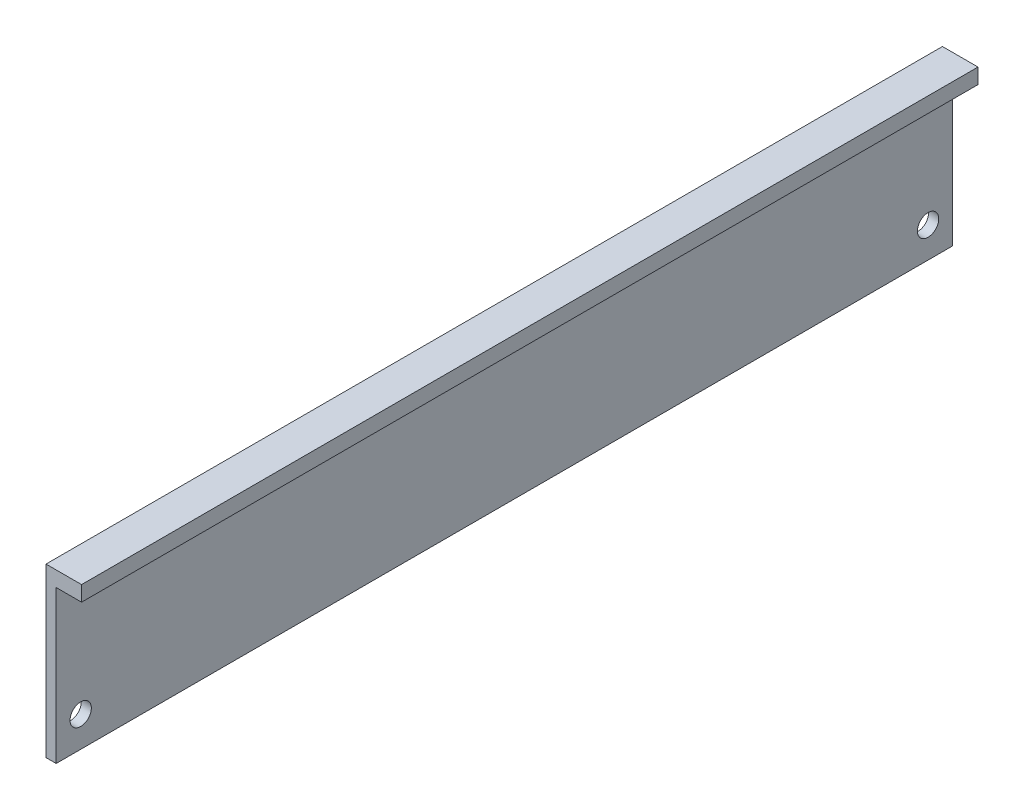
ISO-10303-21;
HEADER;
FILE_DESCRIPTION(('STEP AP214'),'2;1');
FILE_NAME('part.step','',(''),(''),'','','');
FILE_SCHEMA(('AUTOMOTIVE_DESIGN { 1 0 10303 214 1 1 1 1 }'));
ENDSEC;
DATA;
#1=APPLICATION_CONTEXT('core data for automotive mechanical design processes');
#2=APPLICATION_PROTOCOL_DEFINITION('international standard','automotive_design',2000,#1);
#3=PRODUCT_CONTEXT('',#1,'mechanical');
#4=PRODUCT('Part','Part','',(#3));
#5=PRODUCT_RELATED_PRODUCT_CATEGORY('part','',(#4));
#6=PRODUCT_DEFINITION_FORMATION('','',#4);
#7=PRODUCT_DEFINITION_CONTEXT('part definition',#1,'design');
#8=PRODUCT_DEFINITION('design','',#6,#7);
#9=PRODUCT_DEFINITION_SHAPE('','',#8);
#10=(LENGTH_UNIT() NAMED_UNIT(*) SI_UNIT(.MILLI.,.METRE.));
#11=(NAMED_UNIT(*) PLANE_ANGLE_UNIT() SI_UNIT($,.RADIAN.));
#12=(NAMED_UNIT(*) SI_UNIT($,.STERADIAN.) SOLID_ANGLE_UNIT());
#13=UNCERTAINTY_MEASURE_WITH_UNIT(LENGTH_MEASURE(1.E-05),#10,'distance_accuracy_value','');
#14=(GEOMETRIC_REPRESENTATION_CONTEXT(3) GLOBAL_UNCERTAINTY_ASSIGNED_CONTEXT((#13)) GLOBAL_UNIT_ASSIGNED_CONTEXT((#10,
#11,#12)) REPRESENTATION_CONTEXT('',''));
#15=CARTESIAN_POINT('',(0.,0.,0.));
#16=DIRECTION('',(0.,0.,1.));
#17=DIRECTION('',(1.,0.,0.));
#18=AXIS2_PLACEMENT_3D('',#15,#16,#17);
#19=CARTESIAN_POINT('',(4146.36645330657,1662.26594666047,0.));
#20=DIRECTION('',(0.,-1.,0.));
#21=DIRECTION('',(0.,0.,-1.));
#22=AXIS2_PLACEMENT_3D('',#19,#20,#21);
#23=PLANE('',#22);
#24=DIRECTION('',(0.,0.,-1.));
#25=VECTOR('',#24,1.);
#26=CARTESIAN_POINT('',(4148.36645330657,1662.26594666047,0.));
#27=LINE('',#26,#25);
#28=CARTESIAN_POINT('',(4148.36645330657,1662.26594666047,44.45));
#29=VERTEX_POINT('',#28);
#30=CARTESIAN_POINT('',(4148.36645330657,1662.26594666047,-132.));
#31=VERTEX_POINT('',#30);
#32=EDGE_CURVE('E76',#29,#31,#27,.T.);
#33=ORIENTED_EDGE('',*,*,#32,.F.);
#34=DIRECTION('',(1.,0.,0.));
#35=VECTOR('',#34,1.);
#36=CARTESIAN_POINT('',(4146.36645330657,1662.26594666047,44.45));
#37=LINE('',#36,#35);
#38=CARTESIAN_POINT('',(4146.36645330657,1662.26594666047,44.45));
#39=VERTEX_POINT('',#38);
#40=EDGE_CURVE('E98',#39,#29,#37,.T.);
#41=ORIENTED_EDGE('',*,*,#40,.F.);
#42=DIRECTION('',(0.,0.,-1.));
#43=VECTOR('',#42,1.);
#44=CARTESIAN_POINT('',(4146.36645330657,1662.26594666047,0.));
#45=LINE('',#44,#43);
#46=CARTESIAN_POINT('',(4146.36645330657,1662.26594666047,-132.));
#47=VERTEX_POINT('',#46);
#48=EDGE_CURVE('E136',#39,#47,#45,.T.);
#49=ORIENTED_EDGE('',*,*,#48,.T.);
#50=DIRECTION('',(1.,0.,0.));
#51=VECTOR('',#50,1.);
#52=CARTESIAN_POINT('',(4146.36645330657,1662.26594666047,-132.));
#53=LINE('',#52,#51);
#54=EDGE_CURVE('E43',#47,#31,#53,.T.);
#55=ORIENTED_EDGE('',*,*,#54,.T.);
#56=EDGE_LOOP('',(#33,#41,#49,#55));
#57=FACE_BOUND('',#56,.T.);
#58=ADVANCED_FACE('F35',(#57),#23,.T.);
#59=CARTESIAN_POINT('',(4146.36645330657,1695.26594666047,-132.));
#60=DIRECTION('',(0.,1.,0.));
#61=DIRECTION('',(0.,0.,1.));
#62=AXIS2_PLACEMENT_3D('',#59,#60,#61);
#63=PLANE('',#62);
#64=DIRECTION('',(0.,0.,1.));
#65=VECTOR('',#64,1.);
#66=CARTESIAN_POINT('',(4153.36645330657,1695.26594666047,-132.));
#67=LINE('',#66,#65);
#68=CARTESIAN_POINT('',(4153.36645330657,1695.26594666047,-132.));
#69=VERTEX_POINT('',#68);
#70=CARTESIAN_POINT('',(4153.36645330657,1695.26594666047,44.45));
#71=VERTEX_POINT('',#70);
#72=EDGE_CURVE('E139',#69,#71,#67,.T.);
#73=ORIENTED_EDGE('',*,*,#72,.F.);
#74=DIRECTION('',(1.,0.,0.));
#75=VECTOR('',#74,1.);
#76=CARTESIAN_POINT('',(4146.36645330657,1695.26594666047,-132.));
#77=LINE('',#76,#75);
#78=CARTESIAN_POINT('',(4146.36645330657,1695.26594666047,-132.));
#79=VERTEX_POINT('',#78);
#80=EDGE_CURVE('E11',#79,#69,#77,.T.);
#81=ORIENTED_EDGE('',*,*,#80,.F.);
#82=DIRECTION('',(0.,0.,1.));
#83=VECTOR('',#82,1.);
#84=CARTESIAN_POINT('',(4146.36645330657,1695.26594666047,-132.));
#85=LINE('',#84,#83);
#86=CARTESIAN_POINT('',(4146.36645330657,1695.26594666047,44.45));
#87=VERTEX_POINT('',#86);
#88=EDGE_CURVE('E142',#79,#87,#85,.T.);
#89=ORIENTED_EDGE('',*,*,#88,.T.);
#90=DIRECTION('',(-1.,0.,0.));
#91=VECTOR('',#90,1.);
#92=CARTESIAN_POINT('',(4153.36645330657,1695.26594666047,44.45));
#93=LINE('',#92,#91);
#94=EDGE_CURVE('E124',#71,#87,#93,.T.);
#95=ORIENTED_EDGE('',*,*,#94,.F.);
#96=EDGE_LOOP('',(#73,#81,#89,#95));
#97=FACE_BOUND('',#96,.T.);
#98=ADVANCED_FACE('F163',(#97),#63,.T.);
#99=CARTESIAN_POINT('',(4146.36645330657,1662.26594666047,-132.));
#100=DIRECTION('',(0.,0.,-1.));
#101=DIRECTION('',(-1.,0.,0.));
#102=AXIS2_PLACEMENT_3D('',#99,#100,#101);
#103=PLANE('',#102);
#104=DIRECTION('',(0.,1.,0.));
#105=VECTOR('',#104,1.);
#106=CARTESIAN_POINT('',(4148.36645330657,1662.26594666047,-132.));
#107=LINE('',#106,#105);
#108=CARTESIAN_POINT('',(4148.36645330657,1692.26594666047,-132.));
#109=VERTEX_POINT('',#108);
#110=EDGE_CURVE('E131',#31,#109,#107,.T.);
#111=ORIENTED_EDGE('',*,*,#110,.F.);
#112=ORIENTED_EDGE('',*,*,#54,.F.);
#113=DIRECTION('',(0.,1.,0.));
#114=VECTOR('',#113,1.);
#115=CARTESIAN_POINT('',(4146.36645330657,1662.26594666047,-132.));
#116=LINE('',#115,#114);
#117=EDGE_CURVE('E138',#47,#79,#116,.T.);
#118=ORIENTED_EDGE('',*,*,#117,.T.);
#119=ORIENTED_EDGE('',*,*,#80,.T.);
#120=DIRECTION('',(0.,1.,0.));
#121=VECTOR('',#120,1.);
#122=CARTESIAN_POINT('',(4153.36645330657,1662.26594666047,-132.));
#123=LINE('',#122,#121);
#124=CARTESIAN_POINT('',(4153.36645330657,1692.26594666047,-132.));
#125=VERTEX_POINT('',#124);
#126=EDGE_CURVE('E69',#125,#69,#123,.T.);
#127=ORIENTED_EDGE('',*,*,#126,.F.);
#128=DIRECTION('',(1.,0.,0.));
#129=VECTOR('',#128,1.);
#130=CARTESIAN_POINT('',(4148.36645330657,1692.26594666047,-132.));
#131=LINE('',#130,#129);
#132=EDGE_CURVE('E51',#109,#125,#131,.T.);
#133=ORIENTED_EDGE('',*,*,#132,.F.);
#134=EDGE_LOOP('',(#111,#112,#118,#119,#127,#133));
#135=FACE_BOUND('',#134,.T.);
#136=ADVANCED_FACE('F167',(#135),#103,.T.);
#137=CARTESIAN_POINT('',(4146.36645330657,0.,0.));
#138=DIRECTION('',(1.,0.,0.));
#139=DIRECTION('',(0.,0.,-1.));
#140=AXIS2_PLACEMENT_3D('',#137,#138,#139);
#141=PLANE('',#140);
#142=CARTESIAN_POINT('',(4146.36645330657,1668.26594666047,39.62));
#143=DIRECTION('',(-1.,0.,0.));
#144=DIRECTION('',(0.,0.,1.));
#145=AXIS2_PLACEMENT_3D('',#142,#143,#144);
#146=CIRCLE('',#145,2.09999999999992);
#147=CARTESIAN_POINT('',(4146.36645330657,1668.26594666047,41.7199999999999));
#148=VERTEX_POINT('',#147);
#149=EDGE_CURVE('E117',#148,#148,#146,.T.);
#150=ORIENTED_EDGE('',*,*,#149,.F.);
#151=EDGE_LOOP('',(#150));
#152=FACE_BOUND('',#151,.T.);
#153=CARTESIAN_POINT('',(4146.36645330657,1668.26594666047,-127.175));
#154=DIRECTION('',(-1.,0.,0.));
#155=DIRECTION('',(0.,0.,1.));
#156=AXIS2_PLACEMENT_3D('',#153,#154,#155);
#157=CIRCLE('',#156,2.09999999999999);
#158=CARTESIAN_POINT('',(4146.36645330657,1668.26594666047,-125.075));
#159=VERTEX_POINT('',#158);
#160=EDGE_CURVE('E127',#159,#159,#157,.T.);
#161=ORIENTED_EDGE('',*,*,#160,.F.);
#162=EDGE_LOOP('',(#161));
#163=FACE_BOUND('',#162,.T.);
#164=ORIENTED_EDGE('',*,*,#48,.F.);
#165=DIRECTION('',(0.,-1.,0.));
#166=VECTOR('',#165,1.);
#167=CARTESIAN_POINT('',(4146.36645330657,1695.26594666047,44.45));
#168=LINE('',#167,#166);
#169=EDGE_CURVE('E114',#87,#39,#168,.T.);
#170=ORIENTED_EDGE('',*,*,#169,.F.);
#171=ORIENTED_EDGE('',*,*,#88,.F.);
#172=ORIENTED_EDGE('',*,*,#117,.F.);
#173=EDGE_LOOP('',(#164,#170,#171,#172));
#174=FACE_BOUND('',#173,.T.);
#175=ADVANCED_FACE('F172',(#152,#163,#174),#141,.F.);
#176=CARTESIAN_POINT('',(4153.36645330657,0.,0.));
#177=DIRECTION('',(1.,0.,0.));
#178=DIRECTION('',(0.,0.,-1.));
#179=AXIS2_PLACEMENT_3D('',#176,#177,#178);
#180=PLANE('',#179);
#181=DIRECTION('',(0.,0.,-1.));
#182=VECTOR('',#181,1.);
#183=CARTESIAN_POINT('',(4153.36645330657,1692.26594666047,0.));
#184=LINE('',#183,#182);
#185=CARTESIAN_POINT('',(4153.36645330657,1692.26594666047,44.45));
#186=VERTEX_POINT('',#185);
#187=EDGE_CURVE('E99',#186,#125,#184,.T.);
#188=ORIENTED_EDGE('',*,*,#187,.T.);
#189=ORIENTED_EDGE('',*,*,#126,.T.);
#190=ORIENTED_EDGE('',*,*,#72,.T.);
#191=DIRECTION('',(0.,1.,0.));
#192=VECTOR('',#191,1.);
#193=CARTESIAN_POINT('',(4153.36645330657,1692.26594666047,44.45));
#194=LINE('',#193,#192);
#195=EDGE_CURVE('E121',#186,#71,#194,.T.);
#196=ORIENTED_EDGE('',*,*,#195,.F.);
#197=EDGE_LOOP('',(#188,#189,#190,#196));
#198=FACE_BOUND('',#197,.T.);
#199=ADVANCED_FACE('F175',(#198),#180,.T.);
#200=CARTESIAN_POINT('',(4148.36645330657,1662.26594666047,0.));
#201=DIRECTION('',(-1.,0.,0.));
#202=DIRECTION('',(0.,0.,1.));
#203=AXIS2_PLACEMENT_3D('',#200,#201,#202);
#204=PLANE('',#203);
#205=CARTESIAN_POINT('',(4148.36645330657,1668.26594666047,39.62));
#206=DIRECTION('',(-1.,0.,0.));
#207=DIRECTION('',(0.,0.,1.));
#208=AXIS2_PLACEMENT_3D('',#205,#206,#207);
#209=CIRCLE('',#208,2.09999999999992);
#210=CARTESIAN_POINT('',(4148.36645330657,1668.26594666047,41.7199999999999));
#211=VERTEX_POINT('',#210);
#212=EDGE_CURVE('E38',#211,#211,#209,.T.);
#213=ORIENTED_EDGE('',*,*,#212,.T.);
#214=EDGE_LOOP('',(#213));
#215=FACE_BOUND('',#214,.T.);
#216=CARTESIAN_POINT('',(4148.36645330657,1668.26594666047,-127.175));
#217=DIRECTION('',(-1.,0.,0.));
#218=DIRECTION('',(0.,0.,1.));
#219=AXIS2_PLACEMENT_3D('',#216,#217,#218);
#220=CIRCLE('',#219,2.09999999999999);
#221=CARTESIAN_POINT('',(4148.36645330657,1668.26594666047,-125.075));
#222=VERTEX_POINT('',#221);
#223=EDGE_CURVE('E130',#222,#222,#220,.T.);
#224=ORIENTED_EDGE('',*,*,#223,.T.);
#225=EDGE_LOOP('',(#224));
#226=FACE_BOUND('',#225,.T.);
#227=ORIENTED_EDGE('',*,*,#110,.T.);
#228=DIRECTION('',(0.,0.,-1.));
#229=VECTOR('',#228,1.);
#230=CARTESIAN_POINT('',(4148.36645330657,1692.26594666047,0.));
#231=LINE('',#230,#229);
#232=CARTESIAN_POINT('',(4148.36645330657,1692.26594666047,44.45));
#233=VERTEX_POINT('',#232);
#234=EDGE_CURVE('E104',#233,#109,#231,.T.);
#235=ORIENTED_EDGE('',*,*,#234,.F.);
#236=DIRECTION('',(0.,1.,0.));
#237=VECTOR('',#236,1.);
#238=CARTESIAN_POINT('',(4148.36645330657,1662.26594666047,44.45));
#239=LINE('',#238,#237);
#240=EDGE_CURVE('E102',#29,#233,#239,.T.);
#241=ORIENTED_EDGE('',*,*,#240,.F.);
#242=ORIENTED_EDGE('',*,*,#32,.T.);
#243=EDGE_LOOP('',(#227,#235,#241,#242));
#244=FACE_BOUND('',#243,.T.);
#245=ADVANCED_FACE('F103',(#215,#226,#244),#204,.F.);
#246=CARTESIAN_POINT('',(4148.36645330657,1692.26594666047,0.));
#247=DIRECTION('',(0.,1.,0.));
#248=DIRECTION('',(0.,0.,1.));
#249=AXIS2_PLACEMENT_3D('',#246,#247,#248);
#250=PLANE('',#249);
#251=ORIENTED_EDGE('',*,*,#132,.T.);
#252=ORIENTED_EDGE('',*,*,#187,.F.);
#253=DIRECTION('',(1.,0.,0.));
#254=VECTOR('',#253,1.);
#255=CARTESIAN_POINT('',(4148.36645330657,1692.26594666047,44.45));
#256=LINE('',#255,#254);
#257=EDGE_CURVE('E108',#233,#186,#256,.T.);
#258=ORIENTED_EDGE('',*,*,#257,.F.);
#259=ORIENTED_EDGE('',*,*,#234,.T.);
#260=EDGE_LOOP('',(#251,#252,#258,#259));
#261=FACE_BOUND('',#260,.T.);
#262=ADVANCED_FACE('F152',(#261),#250,.F.);
#263=CARTESIAN_POINT('',(4146.36645330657,1668.26594666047,-127.175));
#264=DIRECTION('',(-1.,0.,0.));
#265=DIRECTION('',(0.,0.,1.));
#266=AXIS2_PLACEMENT_3D('',#263,#264,#265);
#267=CYLINDRICAL_SURFACE('',#266,2.09999999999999);
#268=ORIENTED_EDGE('',*,*,#160,.T.);
#269=EDGE_LOOP('',(#268));
#270=FACE_BOUND('',#269,.T.);
#271=ORIENTED_EDGE('',*,*,#223,.F.);
#272=EDGE_LOOP('',(#271));
#273=FACE_BOUND('',#272,.T.);
#274=ADVANCED_FACE('F150',(#270,#273),#267,.F.);
#275=CARTESIAN_POINT('',(0.,0.,44.45));
#276=DIRECTION('',(0.,0.,1.));
#277=DIRECTION('',(1.,0.,0.));
#278=AXIS2_PLACEMENT_3D('',#275,#276,#277);
#279=PLANE('',#278);
#280=ORIENTED_EDGE('',*,*,#40,.T.);
#281=ORIENTED_EDGE('',*,*,#240,.T.);
#282=ORIENTED_EDGE('',*,*,#257,.T.);
#283=ORIENTED_EDGE('',*,*,#195,.T.);
#284=ORIENTED_EDGE('',*,*,#94,.T.);
#285=ORIENTED_EDGE('',*,*,#169,.T.);
#286=EDGE_LOOP('',(#280,#281,#282,#283,#284,#285));
#287=FACE_BOUND('',#286,.T.);
#288=ADVANCED_FACE('F111',(#287),#279,.T.);
#289=CARTESIAN_POINT('',(4153.36645330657,1668.26594666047,39.62));
#290=DIRECTION('',(-1.,0.,0.));
#291=DIRECTION('',(0.,0.,1.));
#292=AXIS2_PLACEMENT_3D('',#289,#290,#291);
#293=CYLINDRICAL_SURFACE('',#292,2.09999999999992);
#294=ORIENTED_EDGE('',*,*,#149,.T.);
#295=EDGE_LOOP('',(#294));
#296=FACE_BOUND('',#295,.T.);
#297=ORIENTED_EDGE('',*,*,#212,.F.);
#298=EDGE_LOOP('',(#297));
#299=FACE_BOUND('',#298,.T.);
#300=ADVANCED_FACE('F159',(#296,#299),#293,.F.);
#301=CLOSED_SHELL('',(#58,#98,#136,#175,#199,#245,#262,#274,#288,#300));
#302=MANIFOLD_SOLID_BREP('B2',#301);
#303=ADVANCED_BREP_SHAPE_REPRESENTATION('',(#18,#302),#14);
#304=SHAPE_DEFINITION_REPRESENTATION(#9,#303);
ENDSEC;
END-ISO-10303-21;
